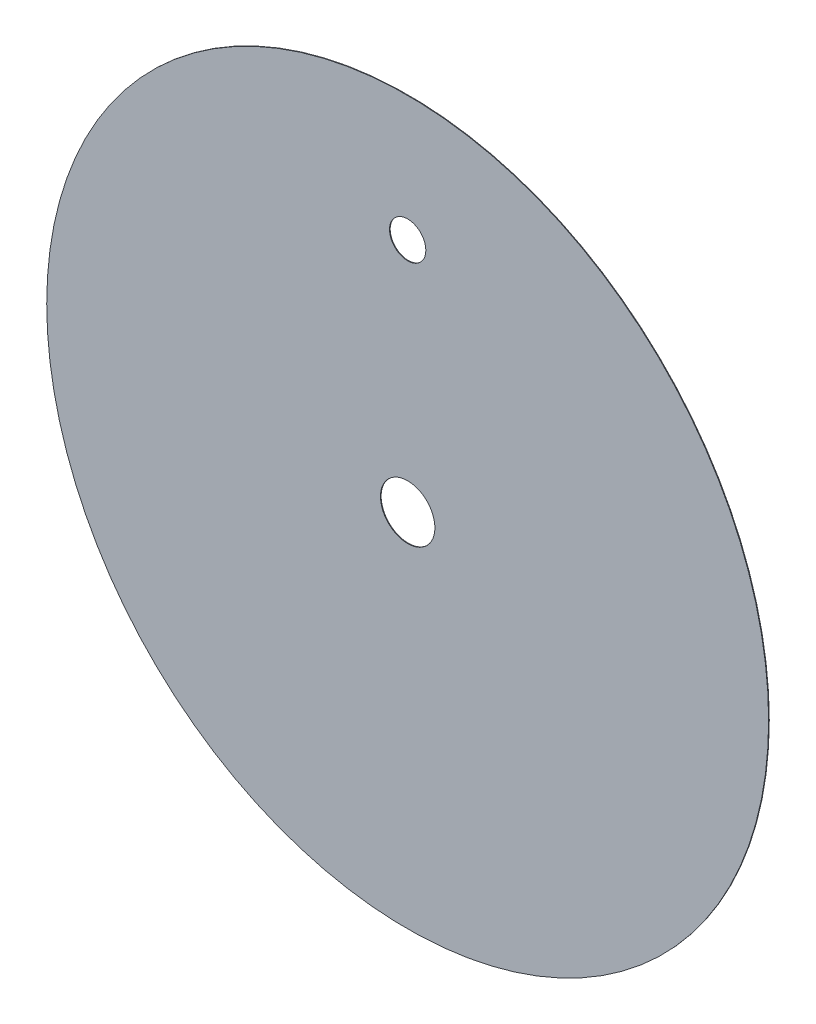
ISO-10303-21;
HEADER;
FILE_DESCRIPTION(('STEP AP214'),'2;1');
FILE_NAME('part.step','',(''),(''),'','','');
FILE_SCHEMA(('AUTOMOTIVE_DESIGN { 1 0 10303 214 1 1 1 1 }'));
ENDSEC;
DATA;
#1=APPLICATION_CONTEXT('core data for automotive mechanical design processes');
#2=APPLICATION_PROTOCOL_DEFINITION('international standard','automotive_design',2000,#1);
#3=PRODUCT_CONTEXT('',#1,'mechanical');
#4=PRODUCT('Part','Part','',(#3));
#5=PRODUCT_RELATED_PRODUCT_CATEGORY('part','',(#4));
#6=PRODUCT_DEFINITION_FORMATION('','',#4);
#7=PRODUCT_DEFINITION_CONTEXT('part definition',#1,'design');
#8=PRODUCT_DEFINITION('design','',#6,#7);
#9=PRODUCT_DEFINITION_SHAPE('','',#8);
#10=(LENGTH_UNIT() NAMED_UNIT(*) SI_UNIT(.MILLI.,.METRE.));
#11=(NAMED_UNIT(*) PLANE_ANGLE_UNIT() SI_UNIT($,.RADIAN.));
#12=(NAMED_UNIT(*) SI_UNIT($,.STERADIAN.) SOLID_ANGLE_UNIT());
#13=UNCERTAINTY_MEASURE_WITH_UNIT(LENGTH_MEASURE(1.E-05),#10,'distance_accuracy_value','');
#14=(GEOMETRIC_REPRESENTATION_CONTEXT(3) GLOBAL_UNCERTAINTY_ASSIGNED_CONTEXT((#13)) GLOBAL_UNIT_ASSIGNED_CONTEXT((#10,
#11,#12)) REPRESENTATION_CONTEXT('',''));
#15=CARTESIAN_POINT('',(0.,0.,0.));
#16=DIRECTION('',(0.,0.,1.));
#17=DIRECTION('',(1.,0.,0.));
#18=AXIS2_PLACEMENT_3D('',#15,#16,#17);
#19=CARTESIAN_POINT('',(0.,0.,0.175));
#20=DIRECTION('',(0.,0.,1.));
#21=DIRECTION('',(1.,0.,0.));
#22=AXIS2_PLACEMENT_3D('',#19,#20,#21);
#23=PLANE('',#22);
#24=CARTESIAN_POINT('',(0.,0.,0.175));
#25=DIRECTION('',(0.,0.,1.));
#26=DIRECTION('',(1.,0.,0.));
#27=AXIS2_PLACEMENT_3D('',#24,#25,#26);
#28=CIRCLE('',#27,7.5);
#29=CARTESIAN_POINT('',(7.5,0.,0.175));
#30=VERTEX_POINT('',#29);
#31=EDGE_CURVE('E41',#30,#30,#28,.T.);
#32=ORIENTED_EDGE('',*,*,#31,.F.);
#33=EDGE_LOOP('',(#32));
#34=FACE_BOUND('',#33,.T.);
#35=CARTESIAN_POINT('',(0.,0.,0.175));
#36=DIRECTION('',(0.,0.,1.));
#37=DIRECTION('',(1.,0.,0.));
#38=AXIS2_PLACEMENT_3D('',#35,#36,#37);
#39=CIRCLE('',#38,99.5);
#40=CARTESIAN_POINT('',(99.5,0.,0.175));
#41=VERTEX_POINT('',#40);
#42=EDGE_CURVE('E10',#41,#41,#39,.T.);
#43=ORIENTED_EDGE('',*,*,#42,.T.);
#44=EDGE_LOOP('',(#43));
#45=FACE_BOUND('',#44,.T.);
#46=CARTESIAN_POINT('',(0.,65.,0.175));
#47=DIRECTION('',(0.,0.,1.));
#48=DIRECTION('',(1.,0.,0.));
#49=AXIS2_PLACEMENT_3D('',#46,#47,#48);
#50=CIRCLE('',#49,5.00000000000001);
#51=CARTESIAN_POINT('',(5.00000000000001,65.,0.175));
#52=VERTEX_POINT('',#51);
#53=EDGE_CURVE('E50',#52,#52,#50,.T.);
#54=ORIENTED_EDGE('',*,*,#53,.F.);
#55=EDGE_LOOP('',(#54));
#56=FACE_BOUND('',#55,.T.);
#57=ADVANCED_FACE('F30',(#34,#45,#56),#23,.T.);
#58=CARTESIAN_POINT('',(0.,0.,0.));
#59=DIRECTION('',(0.,0.,1.));
#60=DIRECTION('',(1.,0.,0.));
#61=AXIS2_PLACEMENT_3D('',#58,#59,#60);
#62=PLANE('',#61);
#63=CARTESIAN_POINT('',(0.,0.,0.));
#64=DIRECTION('',(0.,0.,1.));
#65=DIRECTION('',(1.,0.,0.));
#66=AXIS2_PLACEMENT_3D('',#63,#64,#65);
#67=CIRCLE('',#66,7.5);
#68=CARTESIAN_POINT('',(7.5,0.,0.));
#69=VERTEX_POINT('',#68);
#70=EDGE_CURVE('E45',#69,#69,#67,.T.);
#71=ORIENTED_EDGE('',*,*,#70,.T.);
#72=EDGE_LOOP('',(#71));
#73=FACE_BOUND('',#72,.T.);
#74=CARTESIAN_POINT('',(0.,0.,0.));
#75=DIRECTION('',(0.,0.,1.));
#76=DIRECTION('',(1.,0.,0.));
#77=AXIS2_PLACEMENT_3D('',#74,#75,#76);
#78=CIRCLE('',#77,99.5);
#79=CARTESIAN_POINT('',(99.5,0.,0.));
#80=VERTEX_POINT('',#79);
#81=EDGE_CURVE('E37',#80,#80,#78,.T.);
#82=ORIENTED_EDGE('',*,*,#81,.F.);
#83=EDGE_LOOP('',(#82));
#84=FACE_BOUND('',#83,.T.);
#85=CARTESIAN_POINT('',(0.,65.,0.));
#86=DIRECTION('',(0.,0.,1.));
#87=DIRECTION('',(1.,0.,0.));
#88=AXIS2_PLACEMENT_3D('',#85,#86,#87);
#89=CIRCLE('',#88,5.00000000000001);
#90=CARTESIAN_POINT('',(5.00000000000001,65.,0.));
#91=VERTEX_POINT('',#90);
#92=EDGE_CURVE('E53',#91,#91,#89,.T.);
#93=ORIENTED_EDGE('',*,*,#92,.T.);
#94=EDGE_LOOP('',(#93));
#95=FACE_BOUND('',#94,.T.);
#96=ADVANCED_FACE('F57',(#73,#84,#95),#62,.F.);
#97=CARTESIAN_POINT('',(0.,0.,0.175));
#98=DIRECTION('',(0.,0.,-1.));
#99=DIRECTION('',(-1.,0.,0.));
#100=AXIS2_PLACEMENT_3D('',#97,#98,#99);
#101=CYLINDRICAL_SURFACE('',#100,99.5);
#102=ORIENTED_EDGE('',*,*,#42,.F.);
#103=EDGE_LOOP('',(#102));
#104=FACE_BOUND('',#103,.T.);
#105=ORIENTED_EDGE('',*,*,#81,.T.);
#106=EDGE_LOOP('',(#105));
#107=FACE_BOUND('',#106,.T.);
#108=ADVANCED_FACE('F32',(#104,#107),#101,.T.);
#109=CARTESIAN_POINT('',(0.,0.,0.175));
#110=DIRECTION('',(0.,0.,-1.));
#111=DIRECTION('',(-1.,0.,0.));
#112=AXIS2_PLACEMENT_3D('',#109,#110,#111);
#113=CYLINDRICAL_SURFACE('',#112,7.5);
#114=ORIENTED_EDGE('',*,*,#31,.T.);
#115=EDGE_LOOP('',(#114));
#116=FACE_BOUND('',#115,.T.);
#117=ORIENTED_EDGE('',*,*,#70,.F.);
#118=EDGE_LOOP('',(#117));
#119=FACE_BOUND('',#118,.T.);
#120=ADVANCED_FACE('F61',(#116,#119),#113,.F.);
#121=CARTESIAN_POINT('',(0.,65.,0.175));
#122=DIRECTION('',(0.,0.,-1.));
#123=DIRECTION('',(-1.,0.,0.));
#124=AXIS2_PLACEMENT_3D('',#121,#122,#123);
#125=CYLINDRICAL_SURFACE('',#124,5.00000000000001);
#126=ORIENTED_EDGE('',*,*,#53,.T.);
#127=EDGE_LOOP('',(#126));
#128=FACE_BOUND('',#127,.T.);
#129=ORIENTED_EDGE('',*,*,#92,.F.);
#130=EDGE_LOOP('',(#129));
#131=FACE_BOUND('',#130,.T.);
#132=ADVANCED_FACE('F59',(#128,#131),#125,.F.);
#133=CLOSED_SHELL('',(#57,#96,#108,#120,#132));
#134=MANIFOLD_SOLID_BREP('B2',#133);
#135=ADVANCED_BREP_SHAPE_REPRESENTATION('',(#18,#134),#14);
#136=SHAPE_DEFINITION_REPRESENTATION(#9,#135);
ENDSEC;
END-ISO-10303-21;
